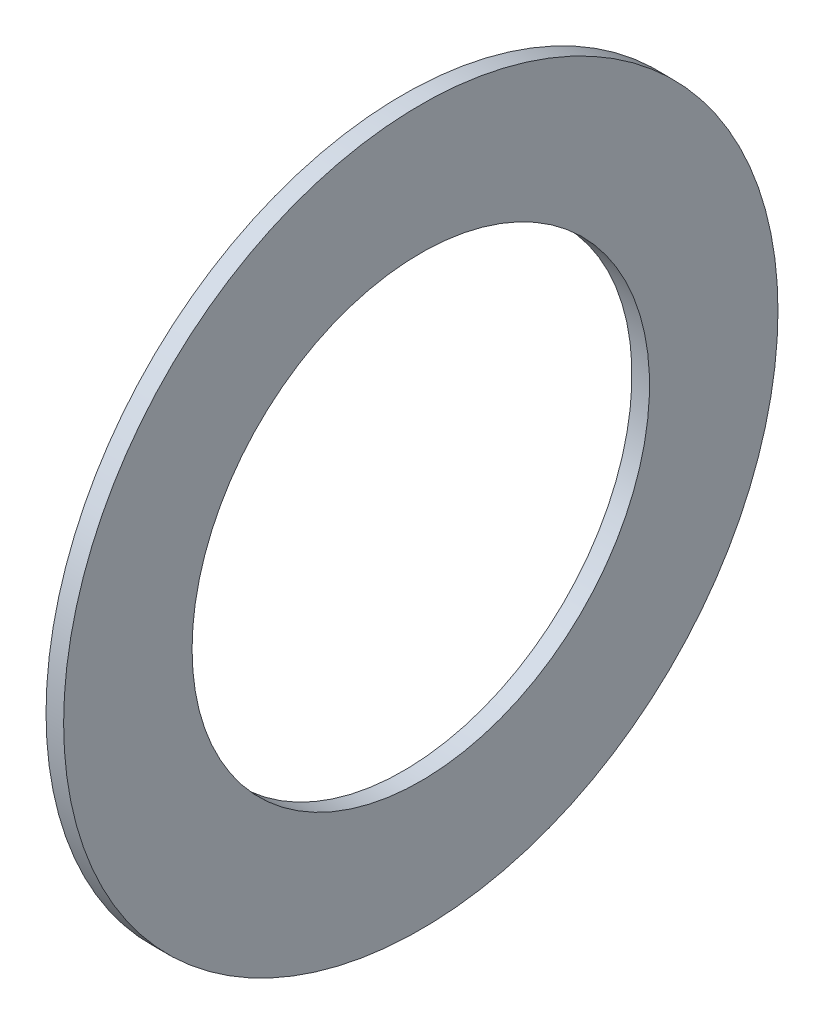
from build123d import *

# Parameters (mm, degrees)
ESQUISSE1_W = 1
ESQUISSE1_H = 7.3


with BuildPart() as part:
    # Esquisse1 → Base-R_volution (revolve)
    with BuildSketch(Plane.XY, mode=Mode.PRIVATE) as base_r_volution_sk:
        with Locations((-0.5, 16.65)):
            Rectangle(ESQUISSE1_W, ESQUISSE1_H)
    revolve(base_r_volution_sk.sketch.rotate(Axis((-16.921408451, 0, 0), (1, 0, 0)), 90), axis=Axis((-16.921408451, 0, 0), (1, 0, 0)))


solid = part.part
